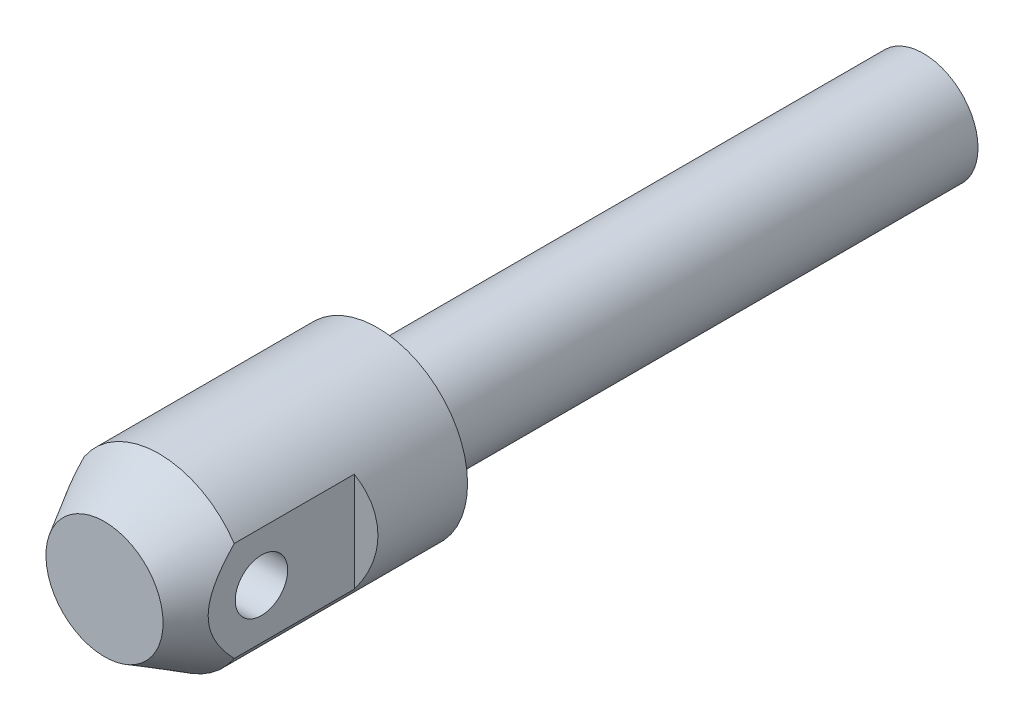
ISO-10303-21;
HEADER;
FILE_DESCRIPTION(('STEP AP214'),'2;1');
FILE_NAME('part.step','',(''),(''),'','','');
FILE_SCHEMA(('AUTOMOTIVE_DESIGN { 1 0 10303 214 1 1 1 1 }'));
ENDSEC;
DATA;
#1=APPLICATION_CONTEXT('core data for automotive mechanical design processes');
#2=APPLICATION_PROTOCOL_DEFINITION('international standard','automotive_design',2000,#1);
#3=PRODUCT_CONTEXT('',#1,'mechanical');
#4=PRODUCT('Part','Part','',(#3));
#5=PRODUCT_RELATED_PRODUCT_CATEGORY('part','',(#4));
#6=PRODUCT_DEFINITION_FORMATION('','',#4);
#7=PRODUCT_DEFINITION_CONTEXT('part definition',#1,'design');
#8=PRODUCT_DEFINITION('design','',#6,#7);
#9=PRODUCT_DEFINITION_SHAPE('','',#8);
#10=(LENGTH_UNIT() NAMED_UNIT(*) SI_UNIT(.MILLI.,.METRE.));
#11=(NAMED_UNIT(*) PLANE_ANGLE_UNIT() SI_UNIT($,.RADIAN.));
#12=(NAMED_UNIT(*) SI_UNIT($,.STERADIAN.) SOLID_ANGLE_UNIT());
#13=UNCERTAINTY_MEASURE_WITH_UNIT(LENGTH_MEASURE(1.E-05),#10,'distance_accuracy_value','');
#14=(GEOMETRIC_REPRESENTATION_CONTEXT(3) GLOBAL_UNCERTAINTY_ASSIGNED_CONTEXT((#13)) GLOBAL_UNIT_ASSIGNED_CONTEXT((#10,
#11,#12)) REPRESENTATION_CONTEXT('',''));
#15=CARTESIAN_POINT('',(0.,0.,0.));
#16=DIRECTION('',(0.,0.,1.));
#17=DIRECTION('',(1.,0.,0.));
#18=AXIS2_PLACEMENT_3D('',#15,#16,#17);
#19=CARTESIAN_POINT('',(0.,0.,20.));
#20=DIRECTION('',(0.,0.,1.));
#21=DIRECTION('',(1.,0.,0.));
#22=AXIS2_PLACEMENT_3D('',#19,#20,#21);
#23=CYLINDRICAL_SURFACE('',#22,16.5);
#24=CARTESIAN_POINT('',(0.,0.,0.));
#25=DIRECTION('',(0.,0.,1.));
#26=DIRECTION('',(1.,0.,0.));
#27=AXIS2_PLACEMENT_3D('',#24,#25,#26);
#28=CIRCLE('',#27,16.5);
#29=CARTESIAN_POINT('',(16.5,0.,0.));
#30=VERTEX_POINT('',#29);
#31=EDGE_CURVE('E82',#30,#30,#28,.T.);
#32=ORIENTED_EDGE('',*,*,#31,.T.);
#33=EDGE_LOOP('',(#32));
#34=FACE_BOUND('',#33,.T.);
#35=CARTESIAN_POINT('',(0.,0.,40.));
#36=DIRECTION('',(0.,0.,1.));
#37=DIRECTION('',(1.,0.,0.));
#38=AXIS2_PLACEMENT_3D('',#35,#36,#37);
#39=CIRCLE('',#38,16.5);
#40=CARTESIAN_POINT('',(-13.75,-9.12071817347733,40.));
#41=VERTEX_POINT('',#40);
#42=CARTESIAN_POINT('',(13.75,-9.12071817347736,40.));
#43=VERTEX_POINT('',#42);
#44=EDGE_CURVE('E67',#41,#43,#39,.T.);
#45=ORIENTED_EDGE('',*,*,#44,.F.);
#46=DIRECTION('',(0.,0.,1.));
#47=VECTOR('',#46,1.);
#48=CARTESIAN_POINT('',(-13.75,-9.12071817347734,20.));
#49=LINE('',#48,#47);
#50=CARTESIAN_POINT('',(-13.75,-9.12071817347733,18.));
#51=VERTEX_POINT('',#50);
#52=EDGE_CURVE('E30',#41,#51,#49,.F.);
#53=ORIENTED_EDGE('',*,*,#52,.T.);
#54=CARTESIAN_POINT('',(0.,0.,25.9385662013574));
#55=DIRECTION('',(0.5,0.,-0.866025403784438));
#56=DIRECTION('',(0.866025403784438,0.,0.5));
#57=AXIS2_PLACEMENT_3D('',#54,#55,#56);
#58=ELLIPSE('',#57,19.0525588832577,16.5);
#59=CARTESIAN_POINT('',(-13.75,9.12071817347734,18.));
#60=VERTEX_POINT('',#59);
#61=EDGE_CURVE('E9',#60,#51,#58,.F.);
#62=ORIENTED_EDGE('',*,*,#61,.F.);
#63=DIRECTION('',(0.,0.,1.));
#64=VECTOR('',#63,1.);
#65=CARTESIAN_POINT('',(-13.75,9.12071817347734,20.));
#66=LINE('',#65,#64);
#67=CARTESIAN_POINT('',(-13.75,9.12071817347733,40.));
#68=VERTEX_POINT('',#67);
#69=EDGE_CURVE('E63',#60,#68,#66,.T.);
#70=ORIENTED_EDGE('',*,*,#69,.T.);
#71=CARTESIAN_POINT('',(13.75,9.12071817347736,40.));
#72=VERTEX_POINT('',#71);
#73=EDGE_CURVE('E79',#72,#68,#39,.T.);
#74=ORIENTED_EDGE('',*,*,#73,.F.);
#75=DIRECTION('',(0.,0.,1.));
#76=VECTOR('',#75,1.);
#77=CARTESIAN_POINT('',(13.75,9.12071817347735,20.));
#78=LINE('',#77,#76);
#79=CARTESIAN_POINT('',(13.75,9.12071817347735,18.));
#80=VERTEX_POINT('',#79);
#81=EDGE_CURVE('E38',#80,#72,#78,.T.);
#82=ORIENTED_EDGE('',*,*,#81,.F.);
#83=CARTESIAN_POINT('',(0.,0.,25.9385662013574));
#84=DIRECTION('',(0.5,0.,0.866025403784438));
#85=DIRECTION('',(-0.866025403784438,0.,0.5));
#86=AXIS2_PLACEMENT_3D('',#83,#84,#85);
#87=ELLIPSE('',#86,19.0525588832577,16.5);
#88=CARTESIAN_POINT('',(13.75,-9.12071817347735,18.));
#89=VERTEX_POINT('',#88);
#90=EDGE_CURVE('E99',#80,#89,#87,.F.);
#91=ORIENTED_EDGE('',*,*,#90,.T.);
#92=DIRECTION('',(0.,0.,1.));
#93=VECTOR('',#92,1.);
#94=CARTESIAN_POINT('',(13.75,-9.12071817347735,20.));
#95=LINE('',#94,#93);
#96=EDGE_CURVE('E74',#43,#89,#95,.F.);
#97=ORIENTED_EDGE('',*,*,#96,.F.);
#98=EDGE_LOOP('',(#45,#53,#62,#70,#74,#82,#91,#97));
#99=FACE_BOUND('',#98,.T.);
#100=ADVANCED_FACE('F14',(#34,#99),#23,.T.);
#101=CARTESIAN_POINT('',(0.,0.,50.));
#102=DIRECTION('',(0.,0.,-1.));
#103=DIRECTION('',(-1.,0.,0.));
#104=AXIS2_PLACEMENT_3D('',#101,#102,#103);
#105=CONICAL_SURFACE('',#104,10.7264973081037,0.523598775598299);
#106=CARTESIAN_POINT('',(0.,0.,50.));
#107=DIRECTION('',(0.,0.,1.));
#108=DIRECTION('',(1.,0.,0.));
#109=AXIS2_PLACEMENT_3D('',#106,#107,#108);
#110=CIRCLE('',#109,10.7264973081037);
#111=CARTESIAN_POINT('',(10.7264973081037,0.,50.));
#112=VERTEX_POINT('',#111);
#113=EDGE_CURVE('E76',#112,#112,#110,.T.);
#114=ORIENTED_EDGE('',*,*,#113,.F.);
#115=EDGE_LOOP('',(#114));
#116=FACE_BOUND('',#115,.T.);
#117=ORIENTED_EDGE('',*,*,#73,.T.);
#118=CARTESIAN_POINT('',(-13.75,-22.2908760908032,23.215450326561));
#119=CARTESIAN_POINT('',(-13.75,-22.0557406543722,23.5620720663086));
#120=CARTESIAN_POINT('',(-13.75,-21.8199072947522,23.9082200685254));
#121=CARTESIAN_POINT('',(-13.75,-21.3467083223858,24.5994700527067));
#122=CARTESIAN_POINT('',(-13.75,-21.1093427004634,24.9445720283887));
#123=CARTESIAN_POINT('',(-13.75,-20.3946726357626,25.9782625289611));
#124=CARTESIAN_POINT('',(-13.75,-19.9148683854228,26.6651272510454));
#125=CARTESIAN_POINT('',(-13.75,-18.9436306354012,28.0383267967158));
#126=CARTESIAN_POINT('',(-13.75,-18.4521369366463,28.7246190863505));
#127=CARTESIAN_POINT('',(-13.75,-17.4592874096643,30.0899583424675));
#128=CARTESIAN_POINT('',(-13.75,-16.9579325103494,30.7690059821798));
#129=CARTESIAN_POINT('',(-13.75,-16.1568934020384,31.8335366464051));
#130=CARTESIAN_POINT('',(-13.75,-15.8612940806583,32.2220942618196));
#131=CARTESIAN_POINT('',(-13.75,-15.2653977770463,32.9955876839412));
#132=CARTESIAN_POINT('',(-13.75,-14.9651008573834,33.3805235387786));
#133=CARTESIAN_POINT('',(-13.75,-14.3590041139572,34.1462734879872));
#134=CARTESIAN_POINT('',(-13.75,-14.0532023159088,34.5270860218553));
#135=CARTESIAN_POINT('',(-13.75,-13.435365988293,35.2836221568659));
#136=CARTESIAN_POINT('',(-13.75,-13.123331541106,35.6593458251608));
#137=CARTESIAN_POINT('',(-13.75,-12.4931356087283,36.4033220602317));
#138=CARTESIAN_POINT('',(-13.75,-12.1750000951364,36.7715965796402));
#139=CARTESIAN_POINT('',(-13.75,-11.5302619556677,37.5007213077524));
#140=CARTESIAN_POINT('',(-13.75,-11.2036588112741,37.8615710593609));
#141=CARTESIAN_POINT('',(-13.75,-10.5406962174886,38.5737791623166));
#142=CARTESIAN_POINT('',(-13.75,-10.2043433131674,38.9251435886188));
#143=CARTESIAN_POINT('',(-13.75,-9.51984349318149,39.616147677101));
#144=CARTESIAN_POINT('',(-13.75,-9.17169871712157,39.9557894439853));
#145=CARTESIAN_POINT('',(-13.75,-8.59989908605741,40.4903555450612));
#146=CARTESIAN_POINT('',(-13.75,-8.38068348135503,40.6900295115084));
#147=CARTESIAN_POINT('',(-13.75,-7.93635754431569,41.0827441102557));
#148=CARTESIAN_POINT('',(-13.75,-7.71124703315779,41.2757845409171));
#149=CARTESIAN_POINT('',(-13.75,-7.25417670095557,41.6542080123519));
#150=CARTESIAN_POINT('',(-13.75,-7.02220861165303,41.8395811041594));
#151=CARTESIAN_POINT('',(-13.75,-6.55098002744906,42.2008257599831));
#152=CARTESIAN_POINT('',(-13.75,-6.31171977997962,42.3766976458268));
#153=CARTESIAN_POINT('',(-13.75,-5.83073947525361,42.7130631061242));
#154=CARTESIAN_POINT('',(-13.75,-5.58920412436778,42.8738181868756));
#155=CARTESIAN_POINT('',(-13.75,-5.09787025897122,43.1820906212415));
#156=CARTESIAN_POINT('',(-13.75,-4.84807053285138,43.3296060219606));
#157=CARTESIAN_POINT('',(-13.75,-4.08642165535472,43.7475970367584));
#158=CARTESIAN_POINT('',(-13.75,-3.56081533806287,43.99461076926));
#159=CARTESIAN_POINT('',(-13.75,-2.78827593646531,44.281531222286));
#160=CARTESIAN_POINT('',(-13.75,-2.55498917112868,44.3588307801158));
#161=CARTESIAN_POINT('',(-13.75,-2.0829743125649,44.4947868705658));
#162=CARTESIAN_POINT('',(-13.75,-1.8442466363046,44.5534448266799));
#163=CARTESIAN_POINT('',(-13.75,-1.36288805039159,44.6500126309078));
#164=CARTESIAN_POINT('',(-13.75,-1.12026201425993,44.6879465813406));
#165=CARTESIAN_POINT('',(-13.75,-0.632546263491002,44.7416774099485));
#166=CARTESIAN_POINT('',(-13.75,-0.387456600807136,44.757474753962));
#167=CARTESIAN_POINT('',(-13.75,0.103935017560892,44.7662733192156));
#168=CARTESIAN_POINT('',(-13.75,0.35023832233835,44.7592001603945));
#169=CARTESIAN_POINT('',(-13.75,0.841126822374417,44.7224022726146));
#170=CARTESIAN_POINT('',(-13.75,1.08571201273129,44.6926774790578));
#171=CARTESIAN_POINT('',(-13.75,1.57163629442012,44.6117390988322));
#172=CARTESIAN_POINT('',(-13.75,1.81297006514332,44.5604938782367));
#173=CARTESIAN_POINT('',(-13.75,2.29060337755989,44.4384042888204));
#174=CARTESIAN_POINT('',(-13.75,2.52690212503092,44.3675568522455));
#175=CARTESIAN_POINT('',(-13.75,3.08787529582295,44.1763196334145));
#176=CARTESIAN_POINT('',(-13.75,3.40967131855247,44.047479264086));
#177=CARTESIAN_POINT('',(-13.75,4.04054004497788,43.7617734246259));
#178=CARTESIAN_POINT('',(-13.75,4.34960570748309,43.6048926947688));
#179=CARTESIAN_POINT('',(-13.75,4.95806988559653,43.2671155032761));
#180=CARTESIAN_POINT('',(-13.75,5.25734890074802,43.0860053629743));
#181=CARTESIAN_POINT('',(-13.75,5.69726521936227,42.8007731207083));
#182=CARTESIAN_POINT('',(-13.75,5.84238521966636,42.7034481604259));
#183=CARTESIAN_POINT('',(-13.75,6.12981607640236,42.5047259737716));
#184=CARTESIAN_POINT('',(-13.75,6.27212690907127,42.4033287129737));
#185=CARTESIAN_POINT('',(-13.75,6.63788685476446,42.1355489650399));
#186=CARTESIAN_POINT('',(-13.75,6.85928516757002,41.9663636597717));
#187=CARTESIAN_POINT('',(-13.75,7.29594519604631,41.6202233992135));
#188=CARTESIAN_POINT('',(-13.75,7.51120599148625,41.4432672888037));
#189=CARTESIAN_POINT('',(-13.75,7.93626705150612,41.0827036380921));
#190=CARTESIAN_POINT('',(-13.75,8.14606435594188,40.8990926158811));
#191=CARTESIAN_POINT('',(-13.75,8.56063050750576,40.5262688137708));
#192=CARTESIAN_POINT('',(-13.75,8.76539900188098,40.3370556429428));
#193=CARTESIAN_POINT('',(-13.75,9.3744173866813,39.7608249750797));
#194=CARTESIAN_POINT('',(-13.75,9.77181904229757,39.3665594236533));
#195=CARTESIAN_POINT('',(-13.75,10.551615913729,38.5637922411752));
#196=CARTESIAN_POINT('',(-13.75,10.9340151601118,38.155294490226));
#197=CARTESIAN_POINT('',(-13.75,11.6616342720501,37.3546816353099));
#198=CARTESIAN_POINT('',(-13.75,12.0076380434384,36.9632764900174));
#199=CARTESIAN_POINT('',(-13.75,12.6907197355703,36.1727114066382));
#200=CARTESIAN_POINT('',(-13.75,13.0277968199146,35.7735507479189));
#201=CARTESIAN_POINT('',(-13.75,13.691396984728,34.9725610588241));
#202=CARTESIAN_POINT('',(-13.75,14.0179874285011,34.5707876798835));
#203=CARTESIAN_POINT('',(-13.75,14.6646823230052,33.7622085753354));
#204=CARTESIAN_POINT('',(-13.75,14.9847883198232,33.3554040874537));
#205=CARTESIAN_POINT('',(-13.75,15.3022091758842,32.9465451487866));
#206=B_SPLINE_CURVE_WITH_KNOTS('',3,(#118,#119,#120,#121,#122,#123,#124,#125,#126,#127,#128,
#129,#130,#131,#132,#133,#134,#135,#136,#137,#138,#139,#140,#141,#142,#143,#144,#145,#146,#147,
#148,#149,#150,#151,#152,#153,#154,#155,#156,#157,#158,#159,#160,#161,#162,#163,#164,#165,#166,
#167,#168,#169,#170,#171,#172,#173,#174,#175,#176,#177,#178,#179,#180,#181,#182,#183,#184,#185,
#186,#187,#188,#189,#190,#191,#192,#193,#194,#195,#196,#197,#198,#199,#200,#201,#202,#203,#204,
#205),.UNSPECIFIED.,.F.,.F.,(4,2,2,2,2,2,2,2,2,2,2,2,2,2,2,2,2,2,2,2,2,2,2,2,2,2,2,2,2,2,2,2,2,
2,2,2,2,2,2,2,2,2,2,4),(0.,1.25654818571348,2.51310390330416,5.0266079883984,7.55894561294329,
10.0910458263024,11.5556682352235,13.0202711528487,14.4854102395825,15.9505299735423,
17.4103979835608,18.8703556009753,20.3293548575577,21.7880907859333,22.6775479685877,
23.5670321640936,24.4576364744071,25.3482105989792,26.2181984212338,27.088314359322,
28.8229872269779,29.5596652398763,30.2962869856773,31.0320501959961,31.767797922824,
32.5059408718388,33.2440859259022,33.9833198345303,34.7226694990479,35.7608204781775,
36.7995381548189,37.8481082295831,38.3722560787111,38.8964083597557,39.7321129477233,
40.5679421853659,41.404215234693,42.2405467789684,43.9193811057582,45.5977612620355,
47.164842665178,48.7320703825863,50.2853040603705,51.8381629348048),.UNSPECIFIED.);
#207=EDGE_CURVE('E23',#68,#41,#206,.F.);
#208=ORIENTED_EDGE('',*,*,#207,.T.);
#209=ORIENTED_EDGE('',*,*,#44,.T.);
#210=CARTESIAN_POINT('',(13.75,-22.2908760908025,23.215450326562));
#211=CARTESIAN_POINT('',(13.75,-22.0557406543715,23.5620720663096));
#212=CARTESIAN_POINT('',(13.75,-21.8199072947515,23.9082200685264));
#213=CARTESIAN_POINT('',(13.75,-21.3467083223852,24.5994700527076));
#214=CARTESIAN_POINT('',(13.75,-21.1093427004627,24.9445720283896));
#215=CARTESIAN_POINT('',(13.75,-20.394672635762,25.9782625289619));
#216=CARTESIAN_POINT('',(13.75,-19.9148683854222,26.6651272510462));
#217=CARTESIAN_POINT('',(13.75,-18.9436306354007,28.0383267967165));
#218=CARTESIAN_POINT('',(13.75,-18.4521369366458,28.7246190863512));
#219=CARTESIAN_POINT('',(13.75,-17.4592874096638,30.0899583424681));
#220=CARTESIAN_POINT('',(13.75,-16.957932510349,30.7690059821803));
#221=CARTESIAN_POINT('',(13.75,-16.156893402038,31.8335366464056));
#222=CARTESIAN_POINT('',(13.75,-15.861294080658,32.2220942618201));
#223=CARTESIAN_POINT('',(13.75,-15.2653977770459,32.9955876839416));
#224=CARTESIAN_POINT('',(13.75,-14.9651008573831,33.380523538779));
#225=CARTESIAN_POINT('',(13.75,-14.359004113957,34.1462734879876));
#226=CARTESIAN_POINT('',(13.75,-14.0532023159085,34.5270860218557));
#227=CARTESIAN_POINT('',(13.75,-13.4353659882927,35.2836221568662));
#228=CARTESIAN_POINT('',(13.75,-13.1233315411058,35.6593458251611));
#229=CARTESIAN_POINT('',(13.75,-12.4931356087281,36.403322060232));
#230=CARTESIAN_POINT('',(13.75,-12.1750000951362,36.7715965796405));
#231=CARTESIAN_POINT('',(13.75,-11.5302619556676,37.5007213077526));
#232=CARTESIAN_POINT('',(13.75,-11.203658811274,37.8615710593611));
#233=CARTESIAN_POINT('',(13.75,-10.5406962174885,38.5737791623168));
#234=CARTESIAN_POINT('',(13.75,-10.2043433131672,38.9251435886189));
#235=CARTESIAN_POINT('',(13.75,-9.51984349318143,39.6161476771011));
#236=CARTESIAN_POINT('',(13.75,-9.17169871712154,39.9557894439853));
#237=CARTESIAN_POINT('',(13.75,-8.59989908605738,40.4903555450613));
#238=CARTESIAN_POINT('',(13.75,-8.38068348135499,40.6900295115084));
#239=CARTESIAN_POINT('',(13.75,-7.93635754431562,41.0827441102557));
#240=CARTESIAN_POINT('',(13.75,-7.71124703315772,41.2757845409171));
#241=CARTESIAN_POINT('',(13.75,-7.25417670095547,41.654208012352));
#242=CARTESIAN_POINT('',(13.75,-7.02220861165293,41.8395811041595));
#243=CARTESIAN_POINT('',(13.75,-6.55098002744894,42.2008257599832));
#244=CARTESIAN_POINT('',(13.75,-6.31171977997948,42.3766976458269));
#245=CARTESIAN_POINT('',(13.75,-5.83073947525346,42.7130631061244));
#246=CARTESIAN_POINT('',(13.75,-5.58920412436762,42.8738181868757));
#247=CARTESIAN_POINT('',(13.75,-5.09787025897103,43.1820906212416));
#248=CARTESIAN_POINT('',(13.75,-4.84807053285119,43.3296060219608));
#249=CARTESIAN_POINT('',(13.75,-4.08642165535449,43.7475970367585));
#250=CARTESIAN_POINT('',(13.75,-3.56081533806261,43.9946107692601));
#251=CARTESIAN_POINT('',(13.75,-2.78827593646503,44.2815312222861));
#252=CARTESIAN_POINT('',(13.75,-2.5549891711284,44.3588307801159));
#253=CARTESIAN_POINT('',(13.75,-2.08297431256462,44.4947868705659));
#254=CARTESIAN_POINT('',(13.75,-1.84424663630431,44.5534448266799));
#255=CARTESIAN_POINT('',(13.75,-1.3628880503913,44.6500126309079));
#256=CARTESIAN_POINT('',(13.75,-1.12026201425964,44.6879465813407));
#257=CARTESIAN_POINT('',(13.75,-0.63254626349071,44.7416774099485));
#258=CARTESIAN_POINT('',(13.75,-0.387456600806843,44.757474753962));
#259=CARTESIAN_POINT('',(13.75,0.103935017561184,44.7662733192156));
#260=CARTESIAN_POINT('',(13.75,0.350238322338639,44.7592001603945));
#261=CARTESIAN_POINT('',(13.75,0.841126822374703,44.7224022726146));
#262=CARTESIAN_POINT('',(13.75,1.08571201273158,44.6926774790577));
#263=CARTESIAN_POINT('',(13.75,1.5716362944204,44.6117390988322));
#264=CARTESIAN_POINT('',(13.75,1.81297006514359,44.5604938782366));
#265=CARTESIAN_POINT('',(13.75,2.29060337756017,44.4384042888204));
#266=CARTESIAN_POINT('',(13.75,2.52690212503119,44.3675568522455));
#267=CARTESIAN_POINT('',(13.75,3.08787529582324,44.1763196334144));
#268=CARTESIAN_POINT('',(13.75,3.40967131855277,44.0474792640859));
#269=CARTESIAN_POINT('',(13.75,4.0405400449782,43.7617734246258));
#270=CARTESIAN_POINT('',(13.75,4.34960570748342,43.6048926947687));
#271=CARTESIAN_POINT('',(13.75,4.95806988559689,43.2671155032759));
#272=CARTESIAN_POINT('',(13.75,5.25734890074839,43.086005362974));
#273=CARTESIAN_POINT('',(13.75,5.69726521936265,42.8007731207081));
#274=CARTESIAN_POINT('',(13.75,5.84238521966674,42.7034481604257));
#275=CARTESIAN_POINT('',(13.75,6.12981607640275,42.5047259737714));
#276=CARTESIAN_POINT('',(13.75,6.27212690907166,42.4033287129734));
#277=CARTESIAN_POINT('',(13.75,6.63788685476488,42.1355489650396));
#278=CARTESIAN_POINT('',(13.75,6.85928516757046,41.9663636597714));
#279=CARTESIAN_POINT('',(13.75,7.2959451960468,41.6202233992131));
#280=CARTESIAN_POINT('',(13.75,7.51120599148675,41.4432672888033));
#281=CARTESIAN_POINT('',(13.75,7.93626705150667,41.0827036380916));
#282=CARTESIAN_POINT('',(13.75,8.14606435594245,40.8990926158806));
#283=CARTESIAN_POINT('',(13.75,8.56063050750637,40.5262688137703));
#284=CARTESIAN_POINT('',(13.75,8.76539900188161,40.3370556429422));
#285=CARTESIAN_POINT('',(13.75,9.37441738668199,39.760824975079));
#286=CARTESIAN_POINT('',(13.75,9.7718190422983,39.3665594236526));
#287=CARTESIAN_POINT('',(13.75,10.5516159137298,38.5637922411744));
#288=CARTESIAN_POINT('',(13.75,10.9340151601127,38.1552944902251));
#289=CARTESIAN_POINT('',(13.75,11.661634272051,37.3546816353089));
#290=CARTESIAN_POINT('',(13.75,12.0076380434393,36.9632764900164));
#291=CARTESIAN_POINT('',(13.75,12.6907197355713,36.1727114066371));
#292=CARTESIAN_POINT('',(13.75,13.0277968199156,35.7735507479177));
#293=CARTESIAN_POINT('',(13.75,13.691396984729,34.9725610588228));
#294=CARTESIAN_POINT('',(13.75,14.0179874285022,34.5707876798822));
#295=CARTESIAN_POINT('',(13.75,14.6646823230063,33.762208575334));
#296=CARTESIAN_POINT('',(13.75,14.9847883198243,33.3554040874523));
#297=CARTESIAN_POINT('',(13.75,15.3022091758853,32.9465451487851));
#298=B_SPLINE_CURVE_WITH_KNOTS('',3,(#210,#211,#212,#213,#214,#215,#216,#217,#218,#219,#220,
#221,#222,#223,#224,#225,#226,#227,#228,#229,#230,#231,#232,#233,#234,#235,#236,#237,#238,#239,
#240,#241,#242,#243,#244,#245,#246,#247,#248,#249,#250,#251,#252,#253,#254,#255,#256,#257,#258,
#259,#260,#261,#262,#263,#264,#265,#266,#267,#268,#269,#270,#271,#272,#273,#274,#275,#276,#277,
#278,#279,#280,#281,#282,#283,#284,#285,#286,#287,#288,#289,#290,#291,#292,#293,#294,#295,#296,
#297),.UNSPECIFIED.,.F.,.F.,(4,2,2,2,2,2,2,2,2,2,2,2,2,2,2,2,2,2,2,2,2,2,2,2,2,2,2,2,2,2,2,2,2,
2,2,2,2,2,2,2,2,2,2,4),(0.,1.25654818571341,2.51310390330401,5.0266079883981,7.55894561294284,
10.0910458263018,11.5556682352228,13.0202711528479,14.4854102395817,15.9505299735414,
17.4103979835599,18.8703556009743,20.3293548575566,21.7880907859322,22.6775479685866,
23.5670321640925,24.4576364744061,25.3482105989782,26.2181984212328,27.088314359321,
28.822987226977,29.5596652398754,30.2962869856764,31.0320501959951,31.7677979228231,
32.5059408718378,33.2440859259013,33.9833198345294,34.7226694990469,35.7608204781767,
36.7995381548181,37.8481082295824,38.3722560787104,38.896408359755,39.7321129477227,
40.5679421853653,41.4042152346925,42.2405467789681,43.9193811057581,45.5977612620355,
47.1648426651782,48.7320703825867,50.2853040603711,51.8381629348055),.UNSPECIFIED.);
#299=EDGE_CURVE('E91',#72,#43,#298,.F.);
#300=ORIENTED_EDGE('',*,*,#299,.F.);
#301=EDGE_LOOP('',(#117,#208,#209,#300));
#302=FACE_BOUND('',#301,.T.);
#303=ADVANCED_FACE('F104',(#116,#302),#105,.T.);
#304=CARTESIAN_POINT('',(0.,10.7264973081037,50.));
#305=DIRECTION('',(0.,0.,-1.));
#306=DIRECTION('',(-1.,0.,0.));
#307=AXIS2_PLACEMENT_3D('',#304,#305,#306);
#308=PLANE('',#307);
#309=ORIENTED_EDGE('',*,*,#113,.T.);
#310=EDGE_LOOP('',(#309));
#311=FACE_BOUND('',#310,.T.);
#312=ADVANCED_FACE('F16',(#311),#308,.F.);
#313=CARTESIAN_POINT('',(0.,10.,-100.));
#314=DIRECTION('',(0.,0.,-1.));
#315=DIRECTION('',(-1.,0.,0.));
#316=AXIS2_PLACEMENT_3D('',#313,#314,#315);
#317=PLANE('',#316);
#318=CARTESIAN_POINT('',(0.,0.,-100.));
#319=DIRECTION('',(0.,0.,1.));
#320=DIRECTION('',(1.,0.,0.));
#321=AXIS2_PLACEMENT_3D('',#318,#319,#320);
#322=CIRCLE('',#321,10.);
#323=CARTESIAN_POINT('',(10.,0.,-100.));
#324=VERTEX_POINT('',#323);
#325=EDGE_CURVE('E88',#324,#324,#322,.T.);
#326=ORIENTED_EDGE('',*,*,#325,.F.);
#327=EDGE_LOOP('',(#326));
#328=FACE_BOUND('',#327,.T.);
#329=ADVANCED_FACE('F147',(#328),#317,.T.);
#330=CARTESIAN_POINT('',(0.,0.,20.));
#331=DIRECTION('',(0.,0.,1.));
#332=DIRECTION('',(1.,0.,0.));
#333=AXIS2_PLACEMENT_3D('',#330,#331,#332);
#334=CYLINDRICAL_SURFACE('',#333,10.);
#335=ORIENTED_EDGE('',*,*,#325,.T.);
#336=EDGE_LOOP('',(#335));
#337=FACE_BOUND('',#336,.T.);
#338=CARTESIAN_POINT('',(0.,0.,0.));
#339=DIRECTION('',(0.,0.,1.));
#340=DIRECTION('',(1.,0.,0.));
#341=AXIS2_PLACEMENT_3D('',#338,#339,#340);
#342=CIRCLE('',#341,10.);
#343=CARTESIAN_POINT('',(10.,0.,0.));
#344=VERTEX_POINT('',#343);
#345=EDGE_CURVE('E85',#344,#344,#342,.T.);
#346=ORIENTED_EDGE('',*,*,#345,.F.);
#347=EDGE_LOOP('',(#346));
#348=FACE_BOUND('',#347,.T.);
#349=ADVANCED_FACE('F134',(#337,#348),#334,.T.);
#350=CARTESIAN_POINT('',(0.,10.,0.));
#351=DIRECTION('',(0.,0.,1.));
#352=DIRECTION('',(1.,0.,0.));
#353=AXIS2_PLACEMENT_3D('',#350,#351,#352);
#354=PLANE('',#353);
#355=ORIENTED_EDGE('',*,*,#31,.F.);
#356=EDGE_LOOP('',(#355));
#357=FACE_BOUND('',#356,.T.);
#358=ORIENTED_EDGE('',*,*,#345,.T.);
#359=EDGE_LOOP('',(#358));
#360=FACE_BOUND('',#359,.T.);
#361=ADVANCED_FACE('F125',(#357,#360),#354,.F.);
#362=CARTESIAN_POINT('',(13.75,-15.,18.));
#363=DIRECTION('',(0.5,0.,0.866025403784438));
#364=DIRECTION('',(0.866025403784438,0.,-0.5));
#365=AXIS2_PLACEMENT_3D('',#362,#363,#364);
#366=PLANE('',#365);
#367=DIRECTION('',(0.,1.,0.));
#368=VECTOR('',#367,1.);
#369=CARTESIAN_POINT('',(13.75,-15.,18.));
#370=LINE('',#369,#368);
#371=EDGE_CURVE('E68',#89,#80,#370,.T.);
#372=ORIENTED_EDGE('',*,*,#371,.F.);
#373=ORIENTED_EDGE('',*,*,#90,.F.);
#374=EDGE_LOOP('',(#372,#373));
#375=FACE_BOUND('',#374,.T.);
#376=ADVANCED_FACE('F123',(#375),#366,.T.);
#377=CARTESIAN_POINT('',(13.75,-15.,18.));
#378=DIRECTION('',(-1.,0.,0.));
#379=DIRECTION('',(0.,0.,1.));
#380=AXIS2_PLACEMENT_3D('',#377,#378,#379);
#381=PLANE('',#380);
#382=CARTESIAN_POINT('',(13.75,0.,35.));
#383=DIRECTION('',(1.,0.,0.));
#384=DIRECTION('',(0.,0.,-1.));
#385=AXIS2_PLACEMENT_3D('',#382,#383,#384);
#386=CIRCLE('',#385,4.8);
#387=CARTESIAN_POINT('',(13.75,0.,30.2));
#388=VERTEX_POINT('',#387);
#389=EDGE_CURVE('E233',#388,#388,#386,.T.);
#390=ORIENTED_EDGE('',*,*,#389,.F.);
#391=EDGE_LOOP('',(#390));
#392=FACE_BOUND('',#391,.T.);
#393=ORIENTED_EDGE('',*,*,#96,.T.);
#394=ORIENTED_EDGE('',*,*,#371,.T.);
#395=ORIENTED_EDGE('',*,*,#81,.T.);
#396=ORIENTED_EDGE('',*,*,#299,.T.);
#397=EDGE_LOOP('',(#393,#394,#395,#396));
#398=FACE_BOUND('',#397,.T.);
#399=ADVANCED_FACE('F101',(#392,#398),#381,.F.);
#400=CARTESIAN_POINT('',(-13.75,-15.,18.));
#401=DIRECTION('',(-1.,0.,0.));
#402=DIRECTION('',(0.,0.,1.));
#403=AXIS2_PLACEMENT_3D('',#400,#401,#402);
#404=PLANE('',#403);
#405=CARTESIAN_POINT('',(-13.75,0.,35.));
#406=DIRECTION('',(-1.,0.,0.));
#407=DIRECTION('',(0.,0.,1.));
#408=AXIS2_PLACEMENT_3D('',#405,#406,#407);
#409=CIRCLE('',#408,4.8);
#410=CARTESIAN_POINT('',(-13.75,0.,39.8));
#411=VERTEX_POINT('',#410);
#412=EDGE_CURVE('E18',#411,#411,#409,.T.);
#413=ORIENTED_EDGE('',*,*,#412,.F.);
#414=EDGE_LOOP('',(#413));
#415=FACE_BOUND('',#414,.T.);
#416=ORIENTED_EDGE('',*,*,#207,.F.);
#417=ORIENTED_EDGE('',*,*,#69,.F.);
#418=DIRECTION('',(0.,1.,0.));
#419=VECTOR('',#418,1.);
#420=CARTESIAN_POINT('',(-13.75,-15.,18.));
#421=LINE('',#420,#419);
#422=EDGE_CURVE('E59',#51,#60,#421,.T.);
#423=ORIENTED_EDGE('',*,*,#422,.F.);
#424=ORIENTED_EDGE('',*,*,#52,.F.);
#425=EDGE_LOOP('',(#416,#417,#423,#424));
#426=FACE_BOUND('',#425,.T.);
#427=ADVANCED_FACE('F62',(#415,#426),#404,.T.);
#428=CARTESIAN_POINT('',(-13.75,-15.,18.));
#429=DIRECTION('',(0.5,0.,-0.866025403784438));
#430=DIRECTION('',(-0.866025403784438,0.,-0.5));
#431=AXIS2_PLACEMENT_3D('',#428,#429,#430);
#432=PLANE('',#431);
#433=ORIENTED_EDGE('',*,*,#61,.T.);
#434=ORIENTED_EDGE('',*,*,#422,.T.);
#435=EDGE_LOOP('',(#433,#434));
#436=FACE_BOUND('',#435,.T.);
#437=ADVANCED_FACE('F58',(#436),#432,.F.);
#438=CARTESIAN_POINT('',(-16.5,0.,35.));
#439=DIRECTION('',(1.,0.,0.));
#440=DIRECTION('',(0.,0.,-1.));
#441=AXIS2_PLACEMENT_3D('',#438,#439,#440);
#442=CYLINDRICAL_SURFACE('',#441,4.8);
#443=ORIENTED_EDGE('',*,*,#412,.T.);
#444=EDGE_LOOP('',(#443));
#445=FACE_BOUND('',#444,.T.);
#446=ORIENTED_EDGE('',*,*,#389,.T.);
#447=EDGE_LOOP('',(#446));
#448=FACE_BOUND('',#447,.T.);
#449=ADVANCED_FACE('F121',(#445,#448),#442,.F.);
#450=CLOSED_SHELL('',(#100,#303,#312,#329,#349,#361,#376,#399,#427,#437,#449));
#451=MANIFOLD_SOLID_BREP('B1',#450);
#452=ADVANCED_BREP_SHAPE_REPRESENTATION('',(#18,#451),#14);
#453=SHAPE_DEFINITION_REPRESENTATION(#9,#452);
ENDSEC;
END-ISO-10303-21;
